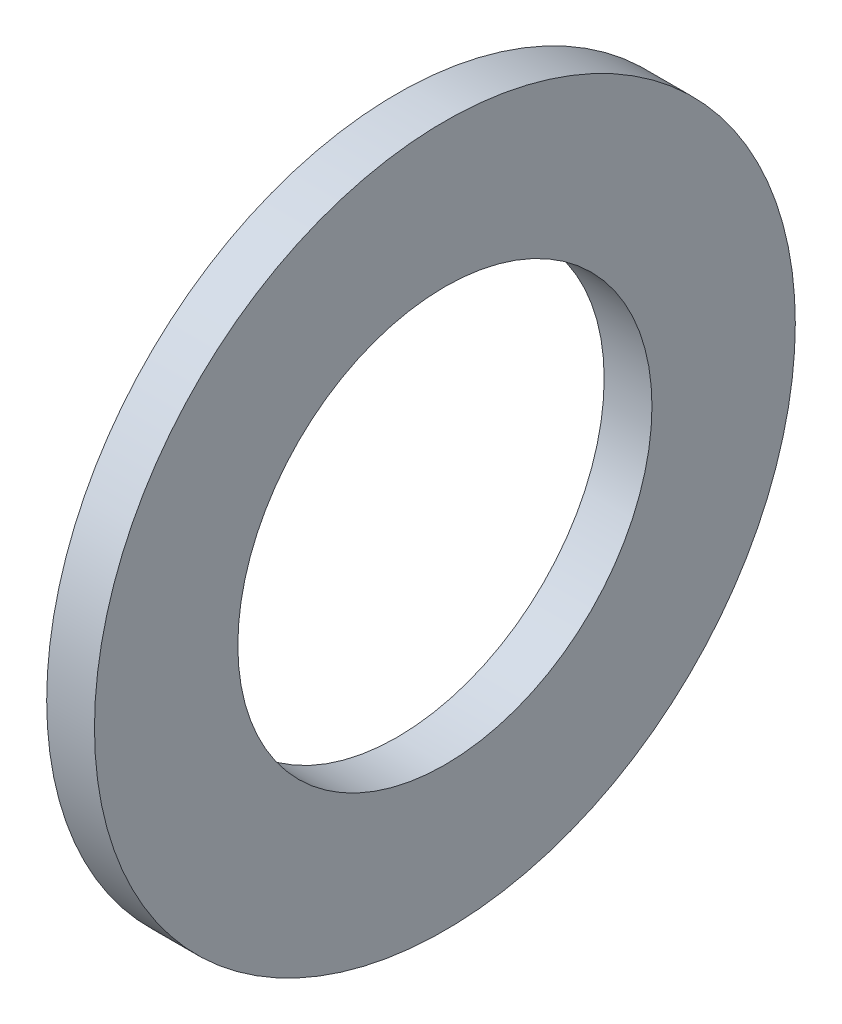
from build123d import *

# Parameters (mm, degrees)
ESQUISSE1_W = 1.5
ESQUISSE1_H = 4.5


with BuildPart() as part:
    # Esquisse1 → Base-R_volution (revolve)
    with BuildSketch(Plane(origin=(0, 0, 0), x_dir=(1, 0, 0), z_dir=(0, 1, 0)), mode=Mode.PRIVATE) as base_r_volution_sk:
        with Locations((0.75, 8.75)):
            Rectangle(ESQUISSE1_W, ESQUISSE1_H)
    revolve(base_r_volution_sk.sketch.rotate(Axis((0, 0, 0), (1, 0, 0)), 180), axis=Axis((0, 0, 0), (1, 0, 0)))


solid = part.part
